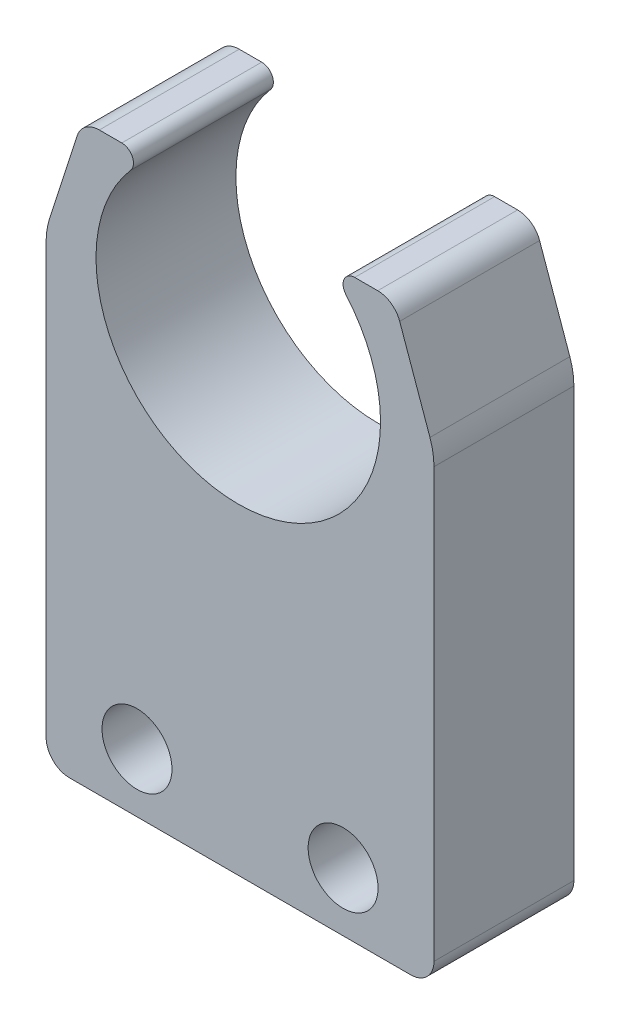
ISO-10303-21;
HEADER;
FILE_DESCRIPTION(('STEP AP214'),'2;1');
FILE_NAME('part.step','',(''),(''),'','','');
FILE_SCHEMA(('AUTOMOTIVE_DESIGN { 1 0 10303 214 1 1 1 1 }'));
ENDSEC;
DATA;
#1=APPLICATION_CONTEXT('core data for automotive mechanical design processes');
#2=APPLICATION_PROTOCOL_DEFINITION('international standard','automotive_design',2000,#1);
#3=PRODUCT_CONTEXT('',#1,'mechanical');
#4=PRODUCT('Part','Part','',(#3));
#5=PRODUCT_RELATED_PRODUCT_CATEGORY('part','',(#4));
#6=PRODUCT_DEFINITION_FORMATION('','',#4);
#7=PRODUCT_DEFINITION_CONTEXT('part definition',#1,'design');
#8=PRODUCT_DEFINITION('design','',#6,#7);
#9=PRODUCT_DEFINITION_SHAPE('','',#8);
#10=(LENGTH_UNIT() NAMED_UNIT(*) SI_UNIT(.MILLI.,.METRE.));
#11=(NAMED_UNIT(*) PLANE_ANGLE_UNIT() SI_UNIT($,.RADIAN.));
#12=(NAMED_UNIT(*) SI_UNIT($,.STERADIAN.) SOLID_ANGLE_UNIT());
#13=UNCERTAINTY_MEASURE_WITH_UNIT(LENGTH_MEASURE(1.E-05),#10,'distance_accuracy_value','');
#14=(GEOMETRIC_REPRESENTATION_CONTEXT(3) GLOBAL_UNCERTAINTY_ASSIGNED_CONTEXT((#13)) GLOBAL_UNIT_ASSIGNED_CONTEXT((#10,
#11,#12)) REPRESENTATION_CONTEXT('',''));
#15=CARTESIAN_POINT('',(0.,0.,0.));
#16=DIRECTION('',(0.,0.,1.));
#17=DIRECTION('',(1.,0.,0.));
#18=AXIS2_PLACEMENT_3D('',#15,#16,#17);
#19=CARTESIAN_POINT('',(-232.312455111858,42.5927181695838,6.));
#20=DIRECTION('',(0.,0.,1.));
#21=DIRECTION('',(1.,0.,0.));
#22=AXIS2_PLACEMENT_3D('',#19,#20,#21);
#23=PLANE('',#22);
#24=CARTESIAN_POINT('',(-231.6607915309,20.9121927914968,6.));
#25=DIRECTION('',(0.,0.,1.));
#26=DIRECTION('',(1.,0.,0.));
#27=AXIS2_PLACEMENT_3D('',#24,#25,#26);
#28=CIRCLE('',#27,1.5);
#29=CARTESIAN_POINT('',(-230.1607915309,20.9121927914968,6.));
#30=VERTEX_POINT('',#29);
#31=EDGE_CURVE('E180',#30,#30,#28,.T.);
#32=ORIENTED_EDGE('',*,*,#31,.F.);
#33=EDGE_LOOP('',(#32));
#34=FACE_BOUND('',#33,.T.);
#35=CARTESIAN_POINT('',(-232.312455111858,42.5927181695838,6.));
#36=DIRECTION('',(0.,0.,1.));
#37=DIRECTION('',(1.,0.,0.));
#38=AXIS2_PLACEMENT_3D('',#35,#36,#37);
#39=CIRCLE('',#38,0.499999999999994);
#40=CARTESIAN_POINT('',(-231.934122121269,42.2658173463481,6.));
#41=VERTEX_POINT('',#40);
#42=CARTESIAN_POINT('',(-232.312455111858,43.0927181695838,6.));
#43=VERTEX_POINT('',#42);
#44=EDGE_CURVE('E207',#41,#43,#39,.T.);
#45=ORIENTED_EDGE('',*,*,#44,.T.);
#46=DIRECTION('',(-1.,0.,0.));
#47=VECTOR('',#46,1.);
#48=CARTESIAN_POINT('',(-233.276341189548,43.0927181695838,6.));
#49=LINE('',#48,#47);
#50=CARTESIAN_POINT('',(-233.276341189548,43.0927181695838,6.));
#51=VERTEX_POINT('',#50);
#52=EDGE_CURVE('E115',#43,#51,#49,.T.);
#53=ORIENTED_EDGE('',*,*,#52,.T.);
#54=CARTESIAN_POINT('',(-233.276341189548,42.0927181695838,6.));
#55=DIRECTION('',(0.,0.,1.));
#56=DIRECTION('',(-1.,0.,0.));
#57=AXIS2_PLACEMENT_3D('',#54,#55,#56);
#58=CIRCLE('',#57,1.00000000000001);
#59=CARTESIAN_POINT('',(-234.228041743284,42.399745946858,6.));
#60=VERTEX_POINT('',#59);
#61=EDGE_CURVE('E246',#51,#60,#58,.T.);
#62=ORIENTED_EDGE('',*,*,#61,.T.);
#63=DIRECTION('',(-0.307027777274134,-0.951700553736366,0.));
#64=VECTOR('',#63,1.);
#65=CARTESIAN_POINT('',(-234.228041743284,42.399745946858,6.));
#66=LINE('',#65,#64);
#67=CARTESIAN_POINT('',(-235.412978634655,38.7267717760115,6.));
#68=VERTEX_POINT('',#67);
#69=EDGE_CURVE('E265',#60,#68,#66,.T.);
#70=ORIENTED_EDGE('',*,*,#69,.T.);
#71=CARTESIAN_POINT('',(-232.557876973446,37.8056884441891,6.));
#72=DIRECTION('',(0.,0.,1.));
#73=DIRECTION('',(-1.,0.,0.));
#74=AXIS2_PLACEMENT_3D('',#71,#72,#73);
#75=CIRCLE('',#74,3.);
#76=CARTESIAN_POINT('',(-235.557876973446,37.8056884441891,6.));
#77=VERTEX_POINT('',#76);
#78=EDGE_CURVE('E262',#68,#77,#75,.T.);
#79=ORIENTED_EDGE('',*,*,#78,.T.);
#80=DIRECTION('',(0.,-1.,0.));
#81=VECTOR('',#80,1.);
#82=CARTESIAN_POINT('',(-235.557876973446,37.8056884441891,6.));
#83=LINE('',#82,#81);
#84=CARTESIAN_POINT('',(-235.557876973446,19.3925642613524,6.));
#85=VERTEX_POINT('',#84);
#86=EDGE_CURVE('E264',#77,#85,#83,.T.);
#87=ORIENTED_EDGE('',*,*,#86,.T.);
#88=CARTESIAN_POINT('',(-234.557876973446,19.3925642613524,6.));
#89=DIRECTION('',(0.,0.,1.));
#90=DIRECTION('',(-1.,0.,0.));
#91=AXIS2_PLACEMENT_3D('',#88,#89,#90);
#92=CIRCLE('',#91,1.);
#93=CARTESIAN_POINT('',(-234.557876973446,18.3925642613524,6.));
#94=VERTEX_POINT('',#93);
#95=EDGE_CURVE('E267',#85,#94,#92,.T.);
#96=ORIENTED_EDGE('',*,*,#95,.T.);
#97=DIRECTION('',(1.,0.,0.));
#98=VECTOR('',#97,1.);
#99=CARTESIAN_POINT('',(-234.557876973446,18.3925642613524,6.));
#100=LINE('',#99,#98);
#101=CARTESIAN_POINT('',(-219.926435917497,18.3925642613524,6.));
#102=VERTEX_POINT('',#101);
#103=EDGE_CURVE('E273',#94,#102,#100,.T.);
#104=ORIENTED_EDGE('',*,*,#103,.T.);
#105=CARTESIAN_POINT('',(-219.926435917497,19.3925642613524,6.));
#106=DIRECTION('',(0.,0.,1.));
#107=DIRECTION('',(-1.,0.,0.));
#108=AXIS2_PLACEMENT_3D('',#105,#106,#107);
#109=CIRCLE('',#108,1.);
#110=CARTESIAN_POINT('',(-218.926435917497,19.3925642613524,6.));
#111=VERTEX_POINT('',#110);
#112=EDGE_CURVE('E275',#102,#111,#109,.T.);
#113=ORIENTED_EDGE('',*,*,#112,.T.);
#114=DIRECTION('',(0.,1.,0.));
#115=VECTOR('',#114,1.);
#116=CARTESIAN_POINT('',(-218.926435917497,37.7618799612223,6.));
#117=LINE('',#116,#115);
#118=CARTESIAN_POINT('',(-218.926435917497,37.7618799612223,6.));
#119=VERTEX_POINT('',#118);
#120=EDGE_CURVE('E277',#111,#119,#117,.T.);
#121=ORIENTED_EDGE('',*,*,#120,.T.);
#122=CARTESIAN_POINT('',(-221.926435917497,37.7618799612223,6.));
#123=DIRECTION('',(0.,0.,1.));
#124=DIRECTION('',(1.,0.,0.));
#125=AXIS2_PLACEMENT_3D('',#122,#123,#124);
#126=CIRCLE('',#125,3.00000000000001);
#127=CARTESIAN_POINT('',(-219.098675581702,38.7637639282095,6.));
#128=VERTEX_POINT('',#127);
#129=EDGE_CURVE('E279',#119,#128,#126,.T.);
#130=ORIENTED_EDGE('',*,*,#129,.T.);
#131=DIRECTION('',(-0.333961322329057,0.942586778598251,0.));
#132=VECTOR('',#131,1.);
#133=CARTESIAN_POINT('',(-220.396457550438,42.4266794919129,6.));
#134=LINE('',#133,#132);
#135=CARTESIAN_POINT('',(-220.396457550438,42.4266794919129,6.));
#136=VERTEX_POINT('',#135);
#137=EDGE_CURVE('E281',#128,#136,#134,.T.);
#138=ORIENTED_EDGE('',*,*,#137,.T.);
#139=CARTESIAN_POINT('',(-221.339044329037,42.0927181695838,6.));
#140=DIRECTION('',(0.,0.,1.));
#141=DIRECTION('',(1.,0.,0.));
#142=AXIS2_PLACEMENT_3D('',#139,#140,#141);
#143=CIRCLE('',#142,1.00000000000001);
#144=CARTESIAN_POINT('',(-221.339044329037,43.0927181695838,6.));
#145=VERTEX_POINT('',#144);
#146=EDGE_CURVE('E158',#136,#145,#143,.T.);
#147=ORIENTED_EDGE('',*,*,#146,.T.);
#148=DIRECTION('',(-1.,0.,0.));
#149=VECTOR('',#148,1.);
#150=CARTESIAN_POINT('',(-222.324464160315,43.0927181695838,6.));
#151=LINE('',#150,#149);
#152=CARTESIAN_POINT('',(-222.324464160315,43.0927181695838,6.));
#153=VERTEX_POINT('',#152);
#154=EDGE_CURVE('E152',#145,#153,#151,.T.);
#155=ORIENTED_EDGE('',*,*,#154,.T.);
#156=CARTESIAN_POINT('',(-222.324464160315,42.5927181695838,6.));
#157=DIRECTION('',(0.,0.,1.));
#158=DIRECTION('',(-1.,0.,0.));
#159=AXIS2_PLACEMENT_3D('',#156,#157,#158);
#160=CIRCLE('',#159,0.499999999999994);
#161=CARTESIAN_POINT('',(-222.702797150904,42.2658173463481,6.));
#162=VERTEX_POINT('',#161);
#163=EDGE_CURVE('E156',#153,#162,#160,.T.);
#164=ORIENTED_EDGE('',*,*,#163,.T.);
#165=CARTESIAN_POINT('',(-227.318459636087,38.2776273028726,6.));
#166=DIRECTION('',(0.,0.,-1.));
#167=DIRECTION('',(1.,0.,0.));
#168=AXIS2_PLACEMENT_3D('',#165,#166,#167);
#169=CIRCLE('',#168,6.1);
#170=EDGE_CURVE('E48',#162,#41,#169,.T.);
#171=ORIENTED_EDGE('',*,*,#170,.T.);
#172=EDGE_LOOP('',(#45,#53,#62,#70,#79,#87,#96,#104,#113,#121,#130,#138,#147,#155,#164,#171));
#173=FACE_BOUND('',#172,.T.);
#174=CARTESIAN_POINT('',(-222.823521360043,20.9121927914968,6.));
#175=DIRECTION('',(0.,0.,1.));
#176=DIRECTION('',(-1.,0.,0.));
#177=AXIS2_PLACEMENT_3D('',#174,#175,#176);
#178=CIRCLE('',#177,1.5);
#179=CARTESIAN_POINT('',(-224.323521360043,20.9121927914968,6.));
#180=VERTEX_POINT('',#179);
#181=EDGE_CURVE('E324',#180,#180,#178,.T.);
#182=ORIENTED_EDGE('',*,*,#181,.F.);
#183=EDGE_LOOP('',(#182));
#184=FACE_BOUND('',#183,.T.);
#185=ADVANCED_FACE('F31',(#34,#173,#184),#23,.T.);
#186=CARTESIAN_POINT('',(-232.312455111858,42.5927181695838,0.));
#187=DIRECTION('',(0.,0.,1.));
#188=DIRECTION('',(1.,0.,0.));
#189=AXIS2_PLACEMENT_3D('',#186,#187,#188);
#190=PLANE('',#189);
#191=CARTESIAN_POINT('',(-231.6607915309,20.9121927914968,0.));
#192=DIRECTION('',(0.,0.,1.));
#193=DIRECTION('',(1.,0.,0.));
#194=AXIS2_PLACEMENT_3D('',#191,#192,#193);
#195=CIRCLE('',#194,1.5);
#196=CARTESIAN_POINT('',(-230.1607915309,20.9121927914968,0.));
#197=VERTEX_POINT('',#196);
#198=EDGE_CURVE('E329',#197,#197,#195,.T.);
#199=ORIENTED_EDGE('',*,*,#198,.T.);
#200=EDGE_LOOP('',(#199));
#201=FACE_BOUND('',#200,.T.);
#202=CARTESIAN_POINT('',(-232.312455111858,42.5927181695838,0.));
#203=DIRECTION('',(0.,0.,1.));
#204=DIRECTION('',(1.,0.,0.));
#205=AXIS2_PLACEMENT_3D('',#202,#203,#204);
#206=CIRCLE('',#205,0.499999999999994);
#207=CARTESIAN_POINT('',(-231.934122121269,42.2658173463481,0.));
#208=VERTEX_POINT('',#207);
#209=CARTESIAN_POINT('',(-232.312455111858,43.0927181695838,0.));
#210=VERTEX_POINT('',#209);
#211=EDGE_CURVE('E176',#208,#210,#206,.T.);
#212=ORIENTED_EDGE('',*,*,#211,.F.);
#213=CARTESIAN_POINT('',(-227.318459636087,38.2776273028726,0.));
#214=DIRECTION('',(0.,0.,-1.));
#215=DIRECTION('',(1.,0.,0.));
#216=AXIS2_PLACEMENT_3D('',#213,#214,#215);
#217=CIRCLE('',#216,6.1);
#218=CARTESIAN_POINT('',(-222.702797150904,42.2658173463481,0.));
#219=VERTEX_POINT('',#218);
#220=EDGE_CURVE('E107',#219,#208,#217,.T.);
#221=ORIENTED_EDGE('',*,*,#220,.F.);
#222=CARTESIAN_POINT('',(-222.324464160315,42.5927181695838,0.));
#223=DIRECTION('',(0.,0.,1.));
#224=DIRECTION('',(-1.,0.,0.));
#225=AXIS2_PLACEMENT_3D('',#222,#223,#224);
#226=CIRCLE('',#225,0.499999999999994);
#227=CARTESIAN_POINT('',(-222.324464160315,43.0927181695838,0.));
#228=VERTEX_POINT('',#227);
#229=EDGE_CURVE('E101',#228,#219,#226,.T.);
#230=ORIENTED_EDGE('',*,*,#229,.F.);
#231=DIRECTION('',(-1.,0.,0.));
#232=VECTOR('',#231,1.);
#233=CARTESIAN_POINT('',(-222.324464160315,43.0927181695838,0.));
#234=LINE('',#233,#232);
#235=CARTESIAN_POINT('',(-221.339044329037,43.0927181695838,0.));
#236=VERTEX_POINT('',#235);
#237=EDGE_CURVE('E166',#236,#228,#234,.T.);
#238=ORIENTED_EDGE('',*,*,#237,.F.);
#239=CARTESIAN_POINT('',(-221.339044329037,42.0927181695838,0.));
#240=DIRECTION('',(0.,0.,1.));
#241=DIRECTION('',(1.,0.,0.));
#242=AXIS2_PLACEMENT_3D('',#239,#240,#241);
#243=CIRCLE('',#242,1.00000000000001);
#244=CARTESIAN_POINT('',(-220.396457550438,42.4266794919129,0.));
#245=VERTEX_POINT('',#244);
#246=EDGE_CURVE('E202',#245,#236,#243,.T.);
#247=ORIENTED_EDGE('',*,*,#246,.F.);
#248=DIRECTION('',(-0.333961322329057,0.942586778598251,0.));
#249=VECTOR('',#248,1.);
#250=CARTESIAN_POINT('',(-220.396457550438,42.4266794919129,0.));
#251=LINE('',#250,#249);
#252=CARTESIAN_POINT('',(-219.098675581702,38.7637639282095,0.));
#253=VERTEX_POINT('',#252);
#254=EDGE_CURVE('E200',#253,#245,#251,.T.);
#255=ORIENTED_EDGE('',*,*,#254,.F.);
#256=CARTESIAN_POINT('',(-221.926435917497,37.7618799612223,0.));
#257=DIRECTION('',(0.,0.,1.));
#258=DIRECTION('',(1.,0.,0.));
#259=AXIS2_PLACEMENT_3D('',#256,#257,#258);
#260=CIRCLE('',#259,3.00000000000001);
#261=CARTESIAN_POINT('',(-218.926435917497,37.7618799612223,0.));
#262=VERTEX_POINT('',#261);
#263=EDGE_CURVE('E198',#262,#253,#260,.T.);
#264=ORIENTED_EDGE('',*,*,#263,.F.);
#265=DIRECTION('',(0.,1.,0.));
#266=VECTOR('',#265,1.);
#267=CARTESIAN_POINT('',(-218.926435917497,37.7618799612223,0.));
#268=LINE('',#267,#266);
#269=CARTESIAN_POINT('',(-218.926435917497,19.3925642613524,0.));
#270=VERTEX_POINT('',#269);
#271=EDGE_CURVE('E196',#270,#262,#268,.T.);
#272=ORIENTED_EDGE('',*,*,#271,.F.);
#273=CARTESIAN_POINT('',(-219.926435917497,19.3925642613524,0.));
#274=DIRECTION('',(0.,0.,1.));
#275=DIRECTION('',(-1.,0.,0.));
#276=AXIS2_PLACEMENT_3D('',#273,#274,#275);
#277=CIRCLE('',#276,1.);
#278=CARTESIAN_POINT('',(-219.926435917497,18.3925642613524,0.));
#279=VERTEX_POINT('',#278);
#280=EDGE_CURVE('E194',#279,#270,#277,.T.);
#281=ORIENTED_EDGE('',*,*,#280,.F.);
#282=DIRECTION('',(1.,0.,0.));
#283=VECTOR('',#282,1.);
#284=CARTESIAN_POINT('',(-234.557876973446,18.3925642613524,0.));
#285=LINE('',#284,#283);
#286=CARTESIAN_POINT('',(-234.557876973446,18.3925642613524,0.));
#287=VERTEX_POINT('',#286);
#288=EDGE_CURVE('E192',#287,#279,#285,.T.);
#289=ORIENTED_EDGE('',*,*,#288,.F.);
#290=CARTESIAN_POINT('',(-234.557876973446,19.3925642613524,0.));
#291=DIRECTION('',(0.,0.,1.));
#292=DIRECTION('',(-1.,0.,0.));
#293=AXIS2_PLACEMENT_3D('',#290,#291,#292);
#294=CIRCLE('',#293,1.);
#295=CARTESIAN_POINT('',(-235.557876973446,19.3925642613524,0.));
#296=VERTEX_POINT('',#295);
#297=EDGE_CURVE('E190',#296,#287,#294,.T.);
#298=ORIENTED_EDGE('',*,*,#297,.F.);
#299=DIRECTION('',(0.,-1.,0.));
#300=VECTOR('',#299,1.);
#301=CARTESIAN_POINT('',(-235.557876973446,37.8056884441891,0.));
#302=LINE('',#301,#300);
#303=CARTESIAN_POINT('',(-235.557876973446,37.8056884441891,0.));
#304=VERTEX_POINT('',#303);
#305=EDGE_CURVE('E188',#304,#296,#302,.T.);
#306=ORIENTED_EDGE('',*,*,#305,.F.);
#307=CARTESIAN_POINT('',(-232.557876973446,37.8056884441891,0.));
#308=DIRECTION('',(0.,0.,1.));
#309=DIRECTION('',(-1.,0.,0.));
#310=AXIS2_PLACEMENT_3D('',#307,#308,#309);
#311=CIRCLE('',#310,3.);
#312=CARTESIAN_POINT('',(-235.412978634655,38.7267717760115,0.));
#313=VERTEX_POINT('',#312);
#314=EDGE_CURVE('E186',#313,#304,#311,.T.);
#315=ORIENTED_EDGE('',*,*,#314,.F.);
#316=DIRECTION('',(-0.307027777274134,-0.951700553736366,0.));
#317=VECTOR('',#316,1.);
#318=CARTESIAN_POINT('',(-234.228041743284,42.399745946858,0.));
#319=LINE('',#318,#317);
#320=CARTESIAN_POINT('',(-234.228041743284,42.399745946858,0.));
#321=VERTEX_POINT('',#320);
#322=EDGE_CURVE('E184',#321,#313,#319,.T.);
#323=ORIENTED_EDGE('',*,*,#322,.F.);
#324=CARTESIAN_POINT('',(-233.276341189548,42.0927181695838,0.));
#325=DIRECTION('',(0.,0.,1.));
#326=DIRECTION('',(-1.,0.,0.));
#327=AXIS2_PLACEMENT_3D('',#324,#325,#326);
#328=CIRCLE('',#327,1.00000000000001);
#329=CARTESIAN_POINT('',(-233.276341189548,43.0927181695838,0.));
#330=VERTEX_POINT('',#329);
#331=EDGE_CURVE('E182',#330,#321,#328,.T.);
#332=ORIENTED_EDGE('',*,*,#331,.F.);
#333=DIRECTION('',(-1.,0.,0.));
#334=VECTOR('',#333,1.);
#335=CARTESIAN_POINT('',(-233.276341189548,43.0927181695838,0.));
#336=LINE('',#335,#334);
#337=EDGE_CURVE('E179',#210,#330,#336,.T.);
#338=ORIENTED_EDGE('',*,*,#337,.F.);
#339=EDGE_LOOP('',(#212,#221,#230,#238,#247,#255,#264,#272,#281,#289,#298,#306,#315,#323,#332,#338));
#340=FACE_BOUND('',#339,.T.);
#341=CARTESIAN_POINT('',(-222.823521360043,20.9121927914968,0.));
#342=DIRECTION('',(0.,0.,1.));
#343=DIRECTION('',(-1.,0.,0.));
#344=AXIS2_PLACEMENT_3D('',#341,#342,#343);
#345=CIRCLE('',#344,1.5);
#346=CARTESIAN_POINT('',(-224.323521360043,20.9121927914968,0.));
#347=VERTEX_POINT('',#346);
#348=EDGE_CURVE('E327',#347,#347,#345,.T.);
#349=ORIENTED_EDGE('',*,*,#348,.T.);
#350=EDGE_LOOP('',(#349));
#351=FACE_BOUND('',#350,.T.);
#352=ADVANCED_FACE('F250',(#201,#340,#351),#190,.F.);
#353=CARTESIAN_POINT('',(-232.312455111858,42.5927181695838,6.));
#354=DIRECTION('',(0.,0.,-1.));
#355=DIRECTION('',(-1.,0.,0.));
#356=AXIS2_PLACEMENT_3D('',#353,#354,#355);
#357=CYLINDRICAL_SURFACE('',#356,0.499999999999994);
#358=ORIENTED_EDGE('',*,*,#211,.T.);
#359=DIRECTION('',(0.,0.,-1.));
#360=VECTOR('',#359,1.);
#361=CARTESIAN_POINT('',(-232.312455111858,43.0927181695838,6.));
#362=LINE('',#361,#360);
#363=EDGE_CURVE('E11',#43,#210,#362,.T.);
#364=ORIENTED_EDGE('',*,*,#363,.F.);
#365=ORIENTED_EDGE('',*,*,#44,.F.);
#366=DIRECTION('',(0.,0.,-1.));
#367=VECTOR('',#366,1.);
#368=CARTESIAN_POINT('',(-231.934122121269,42.2658173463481,6.));
#369=LINE('',#368,#367);
#370=EDGE_CURVE('E172',#41,#208,#369,.T.);
#371=ORIENTED_EDGE('',*,*,#370,.T.);
#372=EDGE_LOOP('',(#358,#364,#365,#371));
#373=FACE_BOUND('',#372,.T.);
#374=ADVANCED_FACE('F33',(#373),#357,.T.);
#375=CARTESIAN_POINT('',(-233.276341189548,43.0927181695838,6.));
#376=DIRECTION('',(0.,-1.,0.));
#377=DIRECTION('',(0.,0.,-1.));
#378=AXIS2_PLACEMENT_3D('',#375,#376,#377);
#379=PLANE('',#378);
#380=ORIENTED_EDGE('',*,*,#337,.T.);
#381=DIRECTION('',(0.,0.,-1.));
#382=VECTOR('',#381,1.);
#383=CARTESIAN_POINT('',(-233.276341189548,43.0927181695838,6.));
#384=LINE('',#383,#382);
#385=EDGE_CURVE('E40',#51,#330,#384,.T.);
#386=ORIENTED_EDGE('',*,*,#385,.F.);
#387=ORIENTED_EDGE('',*,*,#52,.F.);
#388=ORIENTED_EDGE('',*,*,#363,.T.);
#389=EDGE_LOOP('',(#380,#386,#387,#388));
#390=FACE_BOUND('',#389,.T.);
#391=ADVANCED_FACE('F462',(#390),#379,.F.);
#392=CARTESIAN_POINT('',(-233.276341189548,42.0927181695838,6.));
#393=DIRECTION('',(0.,0.,-1.));
#394=DIRECTION('',(-1.,0.,0.));
#395=AXIS2_PLACEMENT_3D('',#392,#393,#394);
#396=CYLINDRICAL_SURFACE('',#395,1.00000000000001);
#397=ORIENTED_EDGE('',*,*,#331,.T.);
#398=DIRECTION('',(0.,0.,-1.));
#399=VECTOR('',#398,1.);
#400=CARTESIAN_POINT('',(-234.228041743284,42.399745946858,6.));
#401=LINE('',#400,#399);
#402=EDGE_CURVE('E238',#60,#321,#401,.T.);
#403=ORIENTED_EDGE('',*,*,#402,.F.);
#404=ORIENTED_EDGE('',*,*,#61,.F.);
#405=ORIENTED_EDGE('',*,*,#385,.T.);
#406=EDGE_LOOP('',(#397,#403,#404,#405));
#407=FACE_BOUND('',#406,.T.);
#408=ADVANCED_FACE('F244',(#407),#396,.T.);
#409=CARTESIAN_POINT('',(-234.228041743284,42.399745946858,6.));
#410=DIRECTION('',(0.951700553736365,-0.307027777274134,0.));
#411=DIRECTION('',(0.307027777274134,0.951700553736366,0.));
#412=AXIS2_PLACEMENT_3D('',#409,#410,#411);
#413=PLANE('',#412);
#414=ORIENTED_EDGE('',*,*,#322,.T.);
#415=DIRECTION('',(0.,0.,-1.));
#416=VECTOR('',#415,1.);
#417=CARTESIAN_POINT('',(-235.412978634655,38.7267717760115,6.));
#418=LINE('',#417,#416);
#419=EDGE_CURVE('E235',#68,#313,#418,.T.);
#420=ORIENTED_EDGE('',*,*,#419,.F.);
#421=ORIENTED_EDGE('',*,*,#69,.F.);
#422=ORIENTED_EDGE('',*,*,#402,.T.);
#423=EDGE_LOOP('',(#414,#420,#421,#422));
#424=FACE_BOUND('',#423,.T.);
#425=ADVANCED_FACE('F256',(#424),#413,.F.);
#426=CARTESIAN_POINT('',(-232.557876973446,37.8056884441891,6.));
#427=DIRECTION('',(0.,0.,-1.));
#428=DIRECTION('',(-1.,0.,0.));
#429=AXIS2_PLACEMENT_3D('',#426,#427,#428);
#430=CYLINDRICAL_SURFACE('',#429,3.);
#431=ORIENTED_EDGE('',*,*,#314,.T.);
#432=DIRECTION('',(0.,0.,-1.));
#433=VECTOR('',#432,1.);
#434=CARTESIAN_POINT('',(-235.557876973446,37.8056884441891,6.));
#435=LINE('',#434,#433);
#436=EDGE_CURVE('E232',#77,#304,#435,.T.);
#437=ORIENTED_EDGE('',*,*,#436,.F.);
#438=ORIENTED_EDGE('',*,*,#78,.F.);
#439=ORIENTED_EDGE('',*,*,#419,.T.);
#440=EDGE_LOOP('',(#431,#437,#438,#439));
#441=FACE_BOUND('',#440,.T.);
#442=ADVANCED_FACE('F260',(#441),#430,.T.);
#443=CARTESIAN_POINT('',(-235.557876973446,37.8056884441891,6.));
#444=DIRECTION('',(1.,0.,0.));
#445=DIRECTION('',(0.,1.,0.));
#446=AXIS2_PLACEMENT_3D('',#443,#444,#445);
#447=PLANE('',#446);
#448=ORIENTED_EDGE('',*,*,#305,.T.);
#449=DIRECTION('',(0.,0.,-1.));
#450=VECTOR('',#449,1.);
#451=CARTESIAN_POINT('',(-235.557876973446,19.3925642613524,6.));
#452=LINE('',#451,#450);
#453=EDGE_CURVE('E229',#85,#296,#452,.T.);
#454=ORIENTED_EDGE('',*,*,#453,.F.);
#455=ORIENTED_EDGE('',*,*,#86,.F.);
#456=ORIENTED_EDGE('',*,*,#436,.T.);
#457=EDGE_LOOP('',(#448,#454,#455,#456));
#458=FACE_BOUND('',#457,.T.);
#459=ADVANCED_FACE('F427',(#458),#447,.F.);
#460=CARTESIAN_POINT('',(-234.557876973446,19.3925642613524,6.));
#461=DIRECTION('',(0.,0.,-1.));
#462=DIRECTION('',(-1.,0.,0.));
#463=AXIS2_PLACEMENT_3D('',#460,#461,#462);
#464=CYLINDRICAL_SURFACE('',#463,1.);
#465=ORIENTED_EDGE('',*,*,#297,.T.);
#466=DIRECTION('',(0.,0.,-1.));
#467=VECTOR('',#466,1.);
#468=CARTESIAN_POINT('',(-234.557876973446,18.3925642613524,6.));
#469=LINE('',#468,#467);
#470=EDGE_CURVE('E226',#94,#287,#469,.T.);
#471=ORIENTED_EDGE('',*,*,#470,.F.);
#472=ORIENTED_EDGE('',*,*,#95,.F.);
#473=ORIENTED_EDGE('',*,*,#453,.T.);
#474=EDGE_LOOP('',(#465,#471,#472,#473));
#475=FACE_BOUND('',#474,.T.);
#476=ADVANCED_FACE('F417',(#475),#464,.T.);
#477=CARTESIAN_POINT('',(-234.557876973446,18.3925642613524,6.));
#478=DIRECTION('',(0.,1.,0.));
#479=DIRECTION('',(0.,0.,1.));
#480=AXIS2_PLACEMENT_3D('',#477,#478,#479);
#481=PLANE('',#480);
#482=ORIENTED_EDGE('',*,*,#288,.T.);
#483=DIRECTION('',(0.,0.,-1.));
#484=VECTOR('',#483,1.);
#485=CARTESIAN_POINT('',(-219.926435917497,18.3925642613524,6.));
#486=LINE('',#485,#484);
#487=EDGE_CURVE('E223',#102,#279,#486,.T.);
#488=ORIENTED_EDGE('',*,*,#487,.F.);
#489=ORIENTED_EDGE('',*,*,#103,.F.);
#490=ORIENTED_EDGE('',*,*,#470,.T.);
#491=EDGE_LOOP('',(#482,#488,#489,#490));
#492=FACE_BOUND('',#491,.T.);
#493=ADVANCED_FACE('F407',(#492),#481,.F.);
#494=CARTESIAN_POINT('',(-219.926435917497,19.3925642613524,6.));
#495=DIRECTION('',(0.,0.,-1.));
#496=DIRECTION('',(-1.,0.,0.));
#497=AXIS2_PLACEMENT_3D('',#494,#495,#496);
#498=CYLINDRICAL_SURFACE('',#497,1.);
#499=ORIENTED_EDGE('',*,*,#280,.T.);
#500=DIRECTION('',(0.,0.,-1.));
#501=VECTOR('',#500,1.);
#502=CARTESIAN_POINT('',(-218.926435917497,19.3925642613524,6.));
#503=LINE('',#502,#501);
#504=EDGE_CURVE('E220',#111,#270,#503,.T.);
#505=ORIENTED_EDGE('',*,*,#504,.F.);
#506=ORIENTED_EDGE('',*,*,#112,.F.);
#507=ORIENTED_EDGE('',*,*,#487,.T.);
#508=EDGE_LOOP('',(#499,#505,#506,#507));
#509=FACE_BOUND('',#508,.T.);
#510=ADVANCED_FACE('F397',(#509),#498,.T.);
#511=CARTESIAN_POINT('',(-218.926435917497,37.7618799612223,6.));
#512=DIRECTION('',(-1.,0.,0.));
#513=DIRECTION('',(0.,-1.,0.));
#514=AXIS2_PLACEMENT_3D('',#511,#512,#513);
#515=PLANE('',#514);
#516=ORIENTED_EDGE('',*,*,#271,.T.);
#517=DIRECTION('',(0.,0.,-1.));
#518=VECTOR('',#517,1.);
#519=CARTESIAN_POINT('',(-218.926435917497,37.7618799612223,6.));
#520=LINE('',#519,#518);
#521=EDGE_CURVE('E217',#119,#262,#520,.T.);
#522=ORIENTED_EDGE('',*,*,#521,.F.);
#523=ORIENTED_EDGE('',*,*,#120,.F.);
#524=ORIENTED_EDGE('',*,*,#504,.T.);
#525=EDGE_LOOP('',(#516,#522,#523,#524));
#526=FACE_BOUND('',#525,.T.);
#527=ADVANCED_FACE('F387',(#526),#515,.F.);
#528=CARTESIAN_POINT('',(-221.926435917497,37.7618799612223,6.));
#529=DIRECTION('',(0.,0.,-1.));
#530=DIRECTION('',(-1.,0.,0.));
#531=AXIS2_PLACEMENT_3D('',#528,#529,#530);
#532=CYLINDRICAL_SURFACE('',#531,3.00000000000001);
#533=ORIENTED_EDGE('',*,*,#263,.T.);
#534=DIRECTION('',(0.,0.,-1.));
#535=VECTOR('',#534,1.);
#536=CARTESIAN_POINT('',(-219.098675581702,38.7637639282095,6.));
#537=LINE('',#536,#535);
#538=EDGE_CURVE('E214',#128,#253,#537,.T.);
#539=ORIENTED_EDGE('',*,*,#538,.F.);
#540=ORIENTED_EDGE('',*,*,#129,.F.);
#541=ORIENTED_EDGE('',*,*,#521,.T.);
#542=EDGE_LOOP('',(#533,#539,#540,#541));
#543=FACE_BOUND('',#542,.T.);
#544=ADVANCED_FACE('F378',(#543),#532,.T.);
#545=CARTESIAN_POINT('',(-220.396457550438,42.4266794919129,6.));
#546=DIRECTION('',(-0.94258677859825,-0.333961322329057,0.));
#547=DIRECTION('',(0.333961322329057,-0.942586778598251,0.));
#548=AXIS2_PLACEMENT_3D('',#545,#546,#547);
#549=PLANE('',#548);
#550=ORIENTED_EDGE('',*,*,#254,.T.);
#551=DIRECTION('',(0.,0.,-1.));
#552=VECTOR('',#551,1.);
#553=CARTESIAN_POINT('',(-220.396457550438,42.4266794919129,6.));
#554=LINE('',#553,#552);
#555=EDGE_CURVE('E211',#136,#245,#554,.T.);
#556=ORIENTED_EDGE('',*,*,#555,.F.);
#557=ORIENTED_EDGE('',*,*,#137,.F.);
#558=ORIENTED_EDGE('',*,*,#538,.T.);
#559=EDGE_LOOP('',(#550,#556,#557,#558));
#560=FACE_BOUND('',#559,.T.);
#561=ADVANCED_FACE('F287',(#560),#549,.F.);
#562=CARTESIAN_POINT('',(-221.339044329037,42.0927181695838,6.));
#563=DIRECTION('',(0.,0.,-1.));
#564=DIRECTION('',(-1.,0.,0.));
#565=AXIS2_PLACEMENT_3D('',#562,#563,#564);
#566=CYLINDRICAL_SURFACE('',#565,1.00000000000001);
#567=ORIENTED_EDGE('',*,*,#246,.T.);
#568=DIRECTION('',(0.,0.,-1.));
#569=VECTOR('',#568,1.);
#570=CARTESIAN_POINT('',(-221.339044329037,43.0927181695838,6.));
#571=LINE('',#570,#569);
#572=EDGE_CURVE('E167',#145,#236,#571,.T.);
#573=ORIENTED_EDGE('',*,*,#572,.F.);
#574=ORIENTED_EDGE('',*,*,#146,.F.);
#575=ORIENTED_EDGE('',*,*,#555,.T.);
#576=EDGE_LOOP('',(#567,#573,#574,#575));
#577=FACE_BOUND('',#576,.T.);
#578=ADVANCED_FACE('F291',(#577),#566,.T.);
#579=CARTESIAN_POINT('',(-222.324464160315,43.0927181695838,6.));
#580=DIRECTION('',(0.,-1.,0.));
#581=DIRECTION('',(0.,0.,-1.));
#582=AXIS2_PLACEMENT_3D('',#579,#580,#581);
#583=PLANE('',#582);
#584=ORIENTED_EDGE('',*,*,#237,.T.);
#585=DIRECTION('',(0.,0.,-1.));
#586=VECTOR('',#585,1.);
#587=CARTESIAN_POINT('',(-222.324464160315,43.0927181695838,6.));
#588=LINE('',#587,#586);
#589=EDGE_CURVE('E163',#153,#228,#588,.T.);
#590=ORIENTED_EDGE('',*,*,#589,.F.);
#591=ORIENTED_EDGE('',*,*,#154,.F.);
#592=ORIENTED_EDGE('',*,*,#572,.T.);
#593=EDGE_LOOP('',(#584,#590,#591,#592));
#594=FACE_BOUND('',#593,.T.);
#595=ADVANCED_FACE('F164',(#594),#583,.F.);
#596=CARTESIAN_POINT('',(-222.324464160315,42.5927181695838,6.));
#597=DIRECTION('',(0.,0.,-1.));
#598=DIRECTION('',(-1.,0.,0.));
#599=AXIS2_PLACEMENT_3D('',#596,#597,#598);
#600=CYLINDRICAL_SURFACE('',#599,0.499999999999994);
#601=ORIENTED_EDGE('',*,*,#229,.T.);
#602=DIRECTION('',(0.,0.,-1.));
#603=VECTOR('',#602,1.);
#604=CARTESIAN_POINT('',(-222.702797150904,42.2658173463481,6.));
#605=LINE('',#604,#603);
#606=EDGE_CURVE('E168',#162,#219,#605,.T.);
#607=ORIENTED_EDGE('',*,*,#606,.F.);
#608=ORIENTED_EDGE('',*,*,#163,.F.);
#609=ORIENTED_EDGE('',*,*,#589,.T.);
#610=EDGE_LOOP('',(#601,#607,#608,#609));
#611=FACE_BOUND('',#610,.T.);
#612=ADVANCED_FACE('F170',(#611),#600,.T.);
#613=CARTESIAN_POINT('',(-227.318459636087,38.2776273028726,6.));
#614=DIRECTION('',(0.,0.,-1.));
#615=DIRECTION('',(-1.,0.,0.));
#616=AXIS2_PLACEMENT_3D('',#613,#614,#615);
#617=CYLINDRICAL_SURFACE('',#616,6.1);
#618=ORIENTED_EDGE('',*,*,#220,.T.);
#619=ORIENTED_EDGE('',*,*,#370,.F.);
#620=ORIENTED_EDGE('',*,*,#170,.F.);
#621=ORIENTED_EDGE('',*,*,#606,.T.);
#622=EDGE_LOOP('',(#618,#619,#620,#621));
#623=FACE_BOUND('',#622,.T.);
#624=ADVANCED_FACE('F295',(#623),#617,.F.);
#625=CARTESIAN_POINT('',(-231.6607915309,20.9121927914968,6.));
#626=DIRECTION('',(0.,0.,-1.));
#627=DIRECTION('',(-1.,0.,0.));
#628=AXIS2_PLACEMENT_3D('',#625,#626,#627);
#629=CYLINDRICAL_SURFACE('',#628,1.5);
#630=ORIENTED_EDGE('',*,*,#31,.T.);
#631=EDGE_LOOP('',(#630));
#632=FACE_BOUND('',#631,.T.);
#633=ORIENTED_EDGE('',*,*,#198,.F.);
#634=EDGE_LOOP('',(#633));
#635=FACE_BOUND('',#634,.T.);
#636=ADVANCED_FACE('F297',(#632,#635),#629,.F.);
#637=CARTESIAN_POINT('',(-222.823521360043,20.9121927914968,6.));
#638=DIRECTION('',(0.,0.,-1.));
#639=DIRECTION('',(-1.,0.,0.));
#640=AXIS2_PLACEMENT_3D('',#637,#638,#639);
#641=CYLINDRICAL_SURFACE('',#640,1.5);
#642=ORIENTED_EDGE('',*,*,#181,.T.);
#643=EDGE_LOOP('',(#642));
#644=FACE_BOUND('',#643,.T.);
#645=ORIENTED_EDGE('',*,*,#348,.F.);
#646=EDGE_LOOP('',(#645));
#647=FACE_BOUND('',#646,.T.);
#648=ADVANCED_FACE('F303',(#644,#647),#641,.F.);
#649=CLOSED_SHELL('',(#185,#352,#374,#391,#408,#425,#442,#459,#476,#493,#510,#527,#544,#561,
#578,#595,#612,#624,#636,#648));
#650=MANIFOLD_SOLID_BREP('B2',#649);
#651=ADVANCED_BREP_SHAPE_REPRESENTATION('',(#18,#650),#14);
#652=SHAPE_DEFINITION_REPRESENTATION(#9,#651);
ENDSEC;
END-ISO-10303-21;
